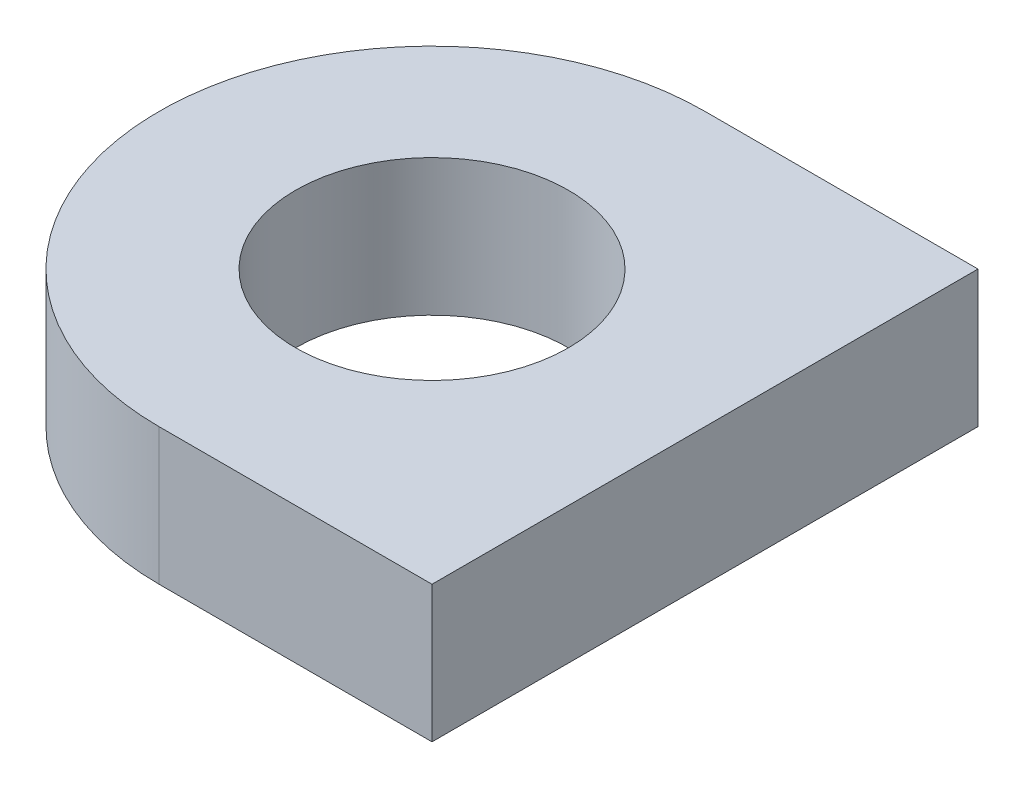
ISO-10303-21;
HEADER;
FILE_DESCRIPTION(('STEP AP214'),'2;1');
FILE_NAME('part.step','',(''),(''),'','','');
FILE_SCHEMA(('AUTOMOTIVE_DESIGN { 1 0 10303 214 1 1 1 1 }'));
ENDSEC;
DATA;
#1=APPLICATION_CONTEXT('core data for automotive mechanical design processes');
#2=APPLICATION_PROTOCOL_DEFINITION('international standard','automotive_design',2000,#1);
#3=PRODUCT_CONTEXT('',#1,'mechanical');
#4=PRODUCT('Part','Part','',(#3));
#5=PRODUCT_RELATED_PRODUCT_CATEGORY('part','',(#4));
#6=PRODUCT_DEFINITION_FORMATION('','',#4);
#7=PRODUCT_DEFINITION_CONTEXT('part definition',#1,'design');
#8=PRODUCT_DEFINITION('design','',#6,#7);
#9=PRODUCT_DEFINITION_SHAPE('','',#8);
#10=(LENGTH_UNIT() NAMED_UNIT(*) SI_UNIT(.MILLI.,.METRE.));
#11=(NAMED_UNIT(*) PLANE_ANGLE_UNIT() SI_UNIT($,.RADIAN.));
#12=(NAMED_UNIT(*) SI_UNIT($,.STERADIAN.) SOLID_ANGLE_UNIT());
#13=UNCERTAINTY_MEASURE_WITH_UNIT(LENGTH_MEASURE(1.E-05),#10,'distance_accuracy_value','');
#14=(GEOMETRIC_REPRESENTATION_CONTEXT(3) GLOBAL_UNCERTAINTY_ASSIGNED_CONTEXT((#13)) GLOBAL_UNIT_ASSIGNED_CONTEXT((#10,
#11,#12)) REPRESENTATION_CONTEXT('',''));
#15=CARTESIAN_POINT('',(0.,0.,0.));
#16=DIRECTION('',(0.,0.,1.));
#17=DIRECTION('',(1.,0.,0.));
#18=AXIS2_PLACEMENT_3D('',#15,#16,#17);
#19=CARTESIAN_POINT('',(3.,2.,-4.));
#20=DIRECTION('',(0.,1.,0.));
#21=DIRECTION('',(-1.,0.,0.));
#22=AXIS2_PLACEMENT_3D('',#19,#20,#21);
#23=PLANE('',#22);
#24=DIRECTION('',(-1.,0.,0.));
#25=VECTOR('',#24,1.);
#26=CARTESIAN_POINT('',(3.,2.,-4.));
#27=LINE('',#26,#25);
#28=CARTESIAN_POINT('',(3.,2.,-4.));
#29=VERTEX_POINT('',#28);
#30=CARTESIAN_POINT('',(-1.,2.,-4.));
#31=VERTEX_POINT('',#30);
#32=EDGE_CURVE('E80',#29,#31,#27,.T.);
#33=ORIENTED_EDGE('',*,*,#32,.T.);
#34=CARTESIAN_POINT('',(-1.,2.,0.));
#35=DIRECTION('',(0.,1.,0.));
#36=DIRECTION('',(0.,0.,-1.));
#37=AXIS2_PLACEMENT_3D('',#34,#35,#36);
#38=CIRCLE('',#37,4.);
#39=CARTESIAN_POINT('',(-1.,2.,4.));
#40=VERTEX_POINT('',#39);
#41=EDGE_CURVE('E71',#31,#40,#38,.T.);
#42=ORIENTED_EDGE('',*,*,#41,.T.);
#43=DIRECTION('',(-1.,0.,0.));
#44=VECTOR('',#43,1.);
#45=CARTESIAN_POINT('',(3.,2.,4.));
#46=LINE('',#45,#44);
#47=CARTESIAN_POINT('',(3.,2.,4.));
#48=VERTEX_POINT('',#47);
#49=EDGE_CURVE('E79',#48,#40,#46,.T.);
#50=ORIENTED_EDGE('',*,*,#49,.F.);
#51=DIRECTION('',(0.,0.,1.));
#52=VECTOR('',#51,1.);
#53=CARTESIAN_POINT('',(3.,2.,-4.));
#54=LINE('',#53,#52);
#55=EDGE_CURVE('E11',#29,#48,#54,.T.);
#56=ORIENTED_EDGE('',*,*,#55,.F.);
#57=EDGE_LOOP('',(#33,#42,#50,#56));
#58=FACE_BOUND('',#57,.T.);
#59=CARTESIAN_POINT('',(-1.,2.,0.));
#60=DIRECTION('',(0.,1.,0.));
#61=DIRECTION('',(-1.,0.,0.));
#62=AXIS2_PLACEMENT_3D('',#59,#60,#61);
#63=CIRCLE('',#62,2.);
#64=CARTESIAN_POINT('',(-3.,2.,0.));
#65=VERTEX_POINT('',#64);
#66=EDGE_CURVE('E91',#65,#65,#63,.T.);
#67=ORIENTED_EDGE('',*,*,#66,.F.);
#68=EDGE_LOOP('',(#67));
#69=FACE_BOUND('',#68,.T.);
#70=ADVANCED_FACE('F32',(#58,#69),#23,.T.);
#71=CARTESIAN_POINT('',(3.,0.,-4.));
#72=DIRECTION('',(1.,0.,0.));
#73=DIRECTION('',(0.,0.,-1.));
#74=AXIS2_PLACEMENT_3D('',#71,#72,#73);
#75=PLANE('',#74);
#76=ORIENTED_EDGE('',*,*,#55,.T.);
#77=DIRECTION('',(0.,1.,0.));
#78=VECTOR('',#77,1.);
#79=CARTESIAN_POINT('',(3.,0.,4.));
#80=LINE('',#79,#78);
#81=CARTESIAN_POINT('',(3.,0.,4.));
#82=VERTEX_POINT('',#81);
#83=EDGE_CURVE('E85',#82,#48,#80,.T.);
#84=ORIENTED_EDGE('',*,*,#83,.F.);
#85=DIRECTION('',(0.,0.,1.));
#86=VECTOR('',#85,1.);
#87=CARTESIAN_POINT('',(3.,0.,-4.));
#88=LINE('',#87,#86);
#89=CARTESIAN_POINT('',(3.,0.,-4.));
#90=VERTEX_POINT('',#89);
#91=EDGE_CURVE('E35',#90,#82,#88,.T.);
#92=ORIENTED_EDGE('',*,*,#91,.F.);
#93=DIRECTION('',(0.,1.,0.));
#94=VECTOR('',#93,1.);
#95=CARTESIAN_POINT('',(3.,0.,-4.));
#96=LINE('',#95,#94);
#97=EDGE_CURVE('E99',#90,#29,#96,.T.);
#98=ORIENTED_EDGE('',*,*,#97,.T.);
#99=EDGE_LOOP('',(#76,#84,#92,#98));
#100=FACE_BOUND('',#99,.T.);
#101=ADVANCED_FACE('F109',(#100),#75,.T.);
#102=CARTESIAN_POINT('',(-5.,0.,-4.));
#103=DIRECTION('',(0.,-1.,0.));
#104=DIRECTION('',(0.,0.,-1.));
#105=AXIS2_PLACEMENT_3D('',#102,#103,#104);
#106=PLANE('',#105);
#107=CARTESIAN_POINT('',(-1.,0.,0.));
#108=DIRECTION('',(0.,1.,0.));
#109=DIRECTION('',(0.,0.,-1.));
#110=AXIS2_PLACEMENT_3D('',#107,#108,#109);
#111=CIRCLE('',#110,4.);
#112=CARTESIAN_POINT('',(-1.,0.,-4.));
#113=VERTEX_POINT('',#112);
#114=CARTESIAN_POINT('',(-1.,0.,4.));
#115=VERTEX_POINT('',#114);
#116=EDGE_CURVE('E46',#113,#115,#111,.T.);
#117=ORIENTED_EDGE('',*,*,#116,.F.);
#118=DIRECTION('',(1.,0.,0.));
#119=VECTOR('',#118,1.);
#120=CARTESIAN_POINT('',(-5.,0.,-4.));
#121=LINE('',#120,#119);
#122=EDGE_CURVE('E97',#113,#90,#121,.T.);
#123=ORIENTED_EDGE('',*,*,#122,.T.);
#124=ORIENTED_EDGE('',*,*,#91,.T.);
#125=DIRECTION('',(1.,0.,0.));
#126=VECTOR('',#125,1.);
#127=CARTESIAN_POINT('',(-5.,0.,4.));
#128=LINE('',#127,#126);
#129=EDGE_CURVE('E86',#115,#82,#128,.T.);
#130=ORIENTED_EDGE('',*,*,#129,.F.);
#131=EDGE_LOOP('',(#117,#123,#124,#130));
#132=FACE_BOUND('',#131,.T.);
#133=CARTESIAN_POINT('',(-1.,0.,0.));
#134=DIRECTION('',(0.,1.,0.));
#135=DIRECTION('',(-1.,0.,0.));
#136=AXIS2_PLACEMENT_3D('',#133,#134,#135);
#137=CIRCLE('',#136,2.);
#138=CARTESIAN_POINT('',(-3.,0.,0.));
#139=VERTEX_POINT('',#138);
#140=EDGE_CURVE('E87',#139,#139,#137,.T.);
#141=ORIENTED_EDGE('',*,*,#140,.T.);
#142=EDGE_LOOP('',(#141));
#143=FACE_BOUND('',#142,.T.);
#144=ADVANCED_FACE('F106',(#132,#143),#106,.T.);
#145=CARTESIAN_POINT('',(0.,0.,-4.));
#146=DIRECTION('',(0.,0.,1.));
#147=DIRECTION('',(1.,0.,0.));
#148=AXIS2_PLACEMENT_3D('',#145,#146,#147);
#149=PLANE('',#148);
#150=ORIENTED_EDGE('',*,*,#122,.F.);
#151=DIRECTION('',(0.,-1.,0.));
#152=VECTOR('',#151,1.);
#153=CARTESIAN_POINT('',(-1.,2.,-4.));
#154=LINE('',#153,#152);
#155=EDGE_CURVE('E76',#31,#113,#154,.T.);
#156=ORIENTED_EDGE('',*,*,#155,.F.);
#157=ORIENTED_EDGE('',*,*,#32,.F.);
#158=ORIENTED_EDGE('',*,*,#97,.F.);
#159=EDGE_LOOP('',(#150,#156,#157,#158));
#160=FACE_BOUND('',#159,.T.);
#161=ADVANCED_FACE('F116',(#160),#149,.F.);
#162=CARTESIAN_POINT('',(0.,0.,4.));
#163=DIRECTION('',(0.,0.,1.));
#164=DIRECTION('',(1.,0.,0.));
#165=AXIS2_PLACEMENT_3D('',#162,#163,#164);
#166=PLANE('',#165);
#167=DIRECTION('',(0.,-1.,0.));
#168=VECTOR('',#167,1.);
#169=CARTESIAN_POINT('',(-1.,2.,4.));
#170=LINE('',#169,#168);
#171=EDGE_CURVE('E68',#40,#115,#170,.T.);
#172=ORIENTED_EDGE('',*,*,#171,.T.);
#173=ORIENTED_EDGE('',*,*,#129,.T.);
#174=ORIENTED_EDGE('',*,*,#83,.T.);
#175=ORIENTED_EDGE('',*,*,#49,.T.);
#176=EDGE_LOOP('',(#172,#173,#174,#175));
#177=FACE_BOUND('',#176,.T.);
#178=ADVANCED_FACE('F83',(#177),#166,.T.);
#179=CARTESIAN_POINT('',(-1.,0.,0.));
#180=DIRECTION('',(0.,1.,0.));
#181=DIRECTION('',(-1.,0.,0.));
#182=AXIS2_PLACEMENT_3D('',#179,#180,#181);
#183=CYLINDRICAL_SURFACE('',#182,2.);
#184=ORIENTED_EDGE('',*,*,#140,.F.);
#185=EDGE_LOOP('',(#184));
#186=FACE_BOUND('',#185,.T.);
#187=ORIENTED_EDGE('',*,*,#66,.T.);
#188=EDGE_LOOP('',(#187));
#189=FACE_BOUND('',#188,.T.);
#190=ADVANCED_FACE('F123',(#186,#189),#183,.F.);
#191=CARTESIAN_POINT('',(-1.,2.,0.));
#192=DIRECTION('',(0.,-1.,0.));
#193=DIRECTION('',(0.,0.,-1.));
#194=AXIS2_PLACEMENT_3D('',#191,#192,#193);
#195=CYLINDRICAL_SURFACE('',#194,4.);
#196=ORIENTED_EDGE('',*,*,#116,.T.);
#197=ORIENTED_EDGE('',*,*,#171,.F.);
#198=ORIENTED_EDGE('',*,*,#41,.F.);
#199=ORIENTED_EDGE('',*,*,#155,.T.);
#200=EDGE_LOOP('',(#196,#197,#198,#199));
#201=FACE_BOUND('',#200,.T.);
#202=ADVANCED_FACE('F70',(#201),#195,.T.);
#203=CLOSED_SHELL('',(#70,#101,#144,#161,#178,#190,#202));
#204=MANIFOLD_SOLID_BREP('B2',#203);
#205=ADVANCED_BREP_SHAPE_REPRESENTATION('',(#18,#204),#14);
#206=SHAPE_DEFINITION_REPRESENTATION(#9,#205);
ENDSEC;
END-ISO-10303-21;
